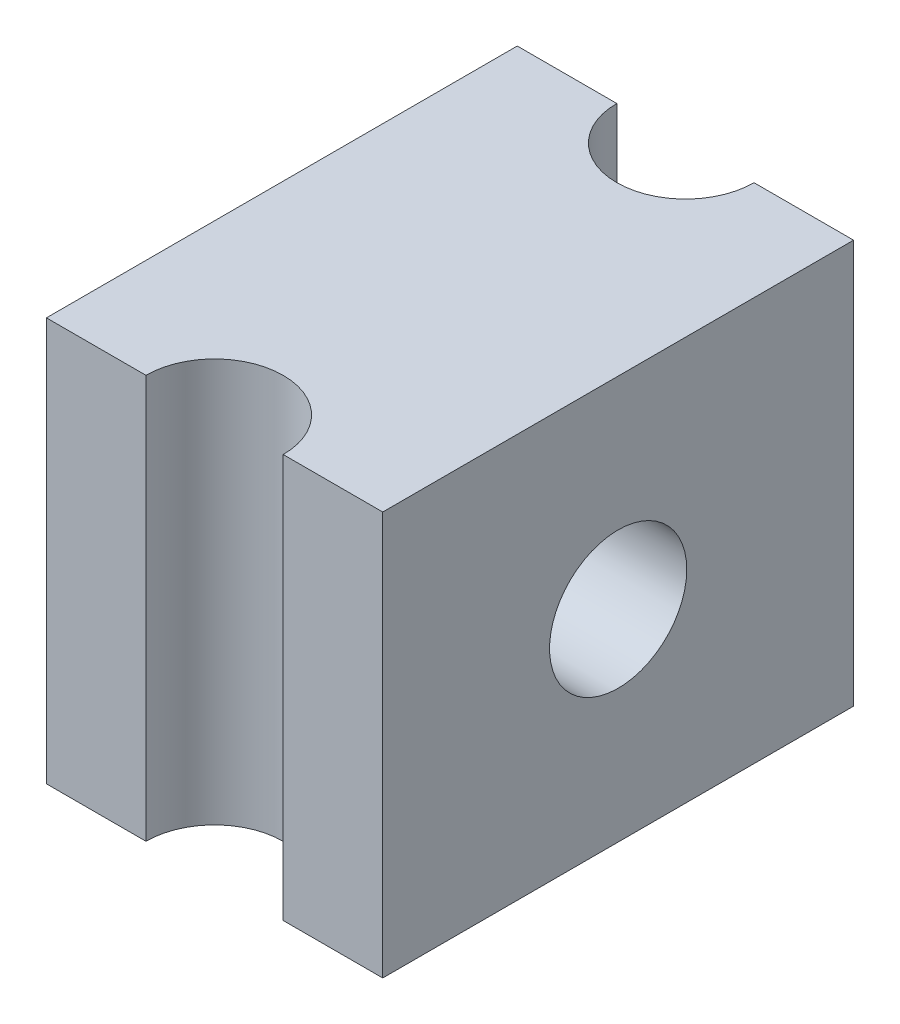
from build123d import *

# Parameters (mm, degrees)
ESQUISSE1_W             = 35
ESQUISSE1_H             = 30
ESQUISSE1_R             = 5.1
EXTRUSION1_DEPTH        = 25
ENL_V_MAT_EXTRU_1_DEPTH = 43.793106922


with BuildPart() as part:
    # Esquisse1 → Extrusion1 (new body)
    with BuildSketch(Plane(origin=(0, 0, 0), x_dir=(0, 0, -1), z_dir=(1, 0, 0))):
        Rectangle(ESQUISSE1_W, ESQUISSE1_H)
        Circle(ESQUISSE1_R, mode=Mode.SUBTRACT)
    extrude(amount=EXTRUSION1_DEPTH)

    # Esquisse2 → Enl_v. mat.-Extru.1 (cut, through all)
    with BuildSketch(Plane(origin=(0, 15, 0), x_dir=(-1, 0, 0), z_dir=(0, 1, 0))):
        with BuildLine():
            Line((-7.4, 17.5), (-17.6, 17.5))
            ThreePointArc((-17.6, 17.5), (-12.5, 12.4), (-7.4, 17.5))
        make_face()
        with BuildLine():
            Line((-7.4, -17.5), (-17.6, -17.5))
            ThreePointArc((-17.6, -17.5), (-12.5, -12.4), (-7.4, -17.5))
        make_face()
    extrude(amount=-ENL_V_MAT_EXTRU_1_DEPTH, mode=Mode.SUBTRACT)


solid = part.part
